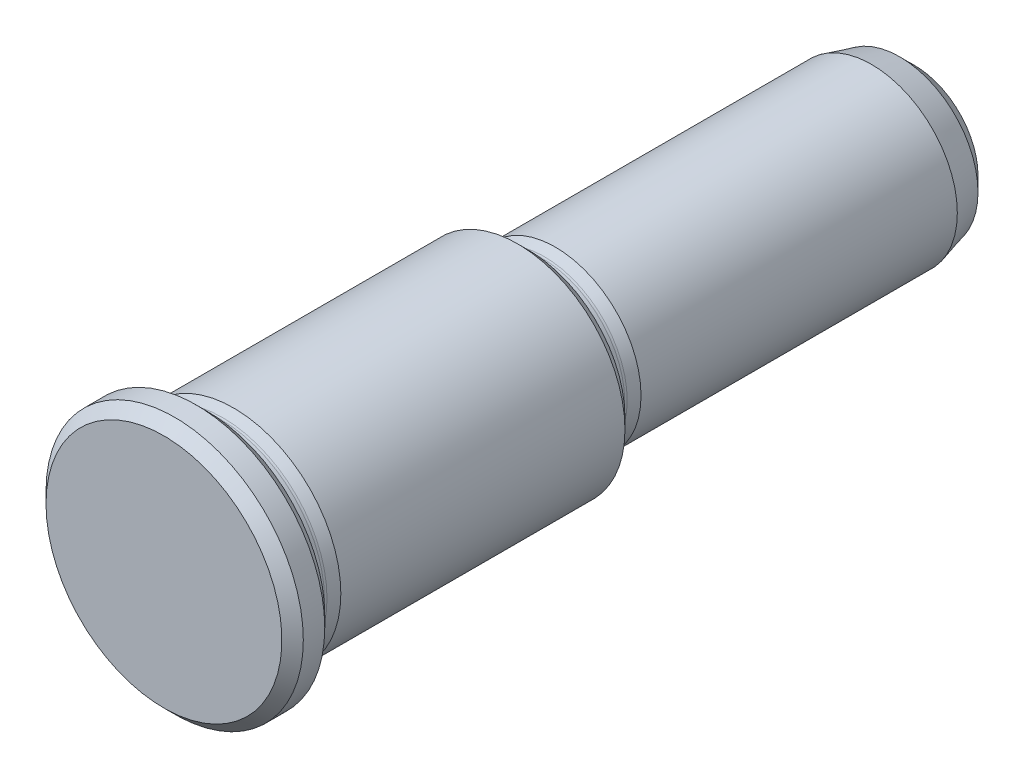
ISO-10303-21;
HEADER;
FILE_DESCRIPTION(('STEP AP214'),'2;1');
FILE_NAME('part.step','',(''),(''),'','','');
FILE_SCHEMA(('AUTOMOTIVE_DESIGN { 1 0 10303 214 1 1 1 1 }'));
ENDSEC;
DATA;
#1=APPLICATION_CONTEXT('core data for automotive mechanical design processes');
#2=APPLICATION_PROTOCOL_DEFINITION('international standard','automotive_design',2000,#1);
#3=PRODUCT_CONTEXT('',#1,'mechanical');
#4=PRODUCT('Part','Part','',(#3));
#5=PRODUCT_RELATED_PRODUCT_CATEGORY('part','',(#4));
#6=PRODUCT_DEFINITION_FORMATION('','',#4);
#7=PRODUCT_DEFINITION_CONTEXT('part definition',#1,'design');
#8=PRODUCT_DEFINITION('design','',#6,#7);
#9=PRODUCT_DEFINITION_SHAPE('','',#8);
#10=(LENGTH_UNIT() NAMED_UNIT(*) SI_UNIT(.MILLI.,.METRE.));
#11=(NAMED_UNIT(*) PLANE_ANGLE_UNIT() SI_UNIT($,.RADIAN.));
#12=(NAMED_UNIT(*) SI_UNIT($,.STERADIAN.) SOLID_ANGLE_UNIT());
#13=UNCERTAINTY_MEASURE_WITH_UNIT(LENGTH_MEASURE(1.E-05),#10,'distance_accuracy_value','');
#14=(GEOMETRIC_REPRESENTATION_CONTEXT(3) GLOBAL_UNCERTAINTY_ASSIGNED_CONTEXT((#13)) GLOBAL_UNIT_ASSIGNED_CONTEXT((#10,
#11,#12)) REPRESENTATION_CONTEXT('',''));
#15=CARTESIAN_POINT('',(0.,0.,0.));
#16=DIRECTION('',(0.,0.,1.));
#17=DIRECTION('',(1.,0.,0.));
#18=AXIS2_PLACEMENT_3D('',#15,#16,#17);
#19=CARTESIAN_POINT('',(0.,0.,0.));
#20=DIRECTION('',(0.,0.,-1.));
#21=DIRECTION('',(-1.,0.,0.));
#22=AXIS2_PLACEMENT_3D('',#19,#20,#21);
#23=PLANE('',#22);
#24=CARTESIAN_POINT('',(0.,0.,0.));
#25=DIRECTION('',(0.,0.,-1.));
#26=DIRECTION('',(-1.,0.,0.));
#27=AXIS2_PLACEMENT_3D('',#24,#25,#26);
#28=CIRCLE('',#27,11.);
#29=CARTESIAN_POINT('',(-11.,0.,0.));
#30=VERTEX_POINT('',#29);
#31=EDGE_CURVE('E9',#30,#30,#28,.F.);
#32=ORIENTED_EDGE('',*,*,#31,.T.);
#33=EDGE_LOOP('',(#32));
#34=FACE_BOUND('',#33,.T.);
#35=ADVANCED_FACE('F14',(#34),#23,.F.);
#36=CARTESIAN_POINT('',(0.,0.,0.));
#37=DIRECTION('',(0.,0.,1.));
#38=DIRECTION('',(1.,0.,0.));
#39=AXIS2_PLACEMENT_3D('',#36,#37,#38);
#40=CYLINDRICAL_SURFACE('',#39,12.);
#41=CARTESIAN_POINT('',(0.,0.,-3.));
#42=DIRECTION('',(0.,0.,1.));
#43=DIRECTION('',(1.,0.,0.));
#44=AXIS2_PLACEMENT_3D('',#41,#42,#43);
#45=CIRCLE('',#44,12.);
#46=CARTESIAN_POINT('',(12.,0.,-3.));
#47=VERTEX_POINT('',#46);
#48=EDGE_CURVE('E25',#47,#47,#45,.T.);
#49=ORIENTED_EDGE('',*,*,#48,.T.);
#50=EDGE_LOOP('',(#49));
#51=FACE_BOUND('',#50,.T.);
#52=CARTESIAN_POINT('',(0.,0.,-1.));
#53=DIRECTION('',(0.,0.,-1.));
#54=DIRECTION('',(-1.,0.,0.));
#55=AXIS2_PLACEMENT_3D('',#52,#53,#54);
#56=CIRCLE('',#55,12.);
#57=CARTESIAN_POINT('',(-12.,0.,-1.));
#58=VERTEX_POINT('',#57);
#59=EDGE_CURVE('E29',#58,#58,#56,.T.);
#60=ORIENTED_EDGE('',*,*,#59,.T.);
#61=EDGE_LOOP('',(#60));
#62=FACE_BOUND('',#61,.T.);
#63=ADVANCED_FACE('F100',(#51,#62),#40,.T.);
#64=CARTESIAN_POINT('',(0.,12.,-4.));
#65=DIRECTION('',(0.,0.,1.));
#66=DIRECTION('',(1.,0.,0.));
#67=AXIS2_PLACEMENT_3D('',#64,#65,#66);
#68=PLANE('',#67);
#69=CARTESIAN_POINT('',(0.,0.,-4.));
#70=DIRECTION('',(0.,0.,1.));
#71=DIRECTION('',(1.,0.,0.));
#72=AXIS2_PLACEMENT_3D('',#69,#70,#71);
#73=CIRCLE('',#72,11.);
#74=CARTESIAN_POINT('',(11.,0.,-4.));
#75=VERTEX_POINT('',#74);
#76=EDGE_CURVE('E21',#75,#75,#73,.F.);
#77=ORIENTED_EDGE('',*,*,#76,.T.);
#78=EDGE_LOOP('',(#77));
#79=FACE_BOUND('',#78,.T.);
#80=CARTESIAN_POINT('',(0.,0.,-4.));
#81=DIRECTION('',(0.,0.,1.));
#82=DIRECTION('',(1.,0.,0.));
#83=AXIS2_PLACEMENT_3D('',#80,#81,#82);
#84=CIRCLE('',#83,10.5);
#85=CARTESIAN_POINT('',(10.5,0.,-4.));
#86=VERTEX_POINT('',#85);
#87=EDGE_CURVE('E46',#86,#86,#84,.T.);
#88=ORIENTED_EDGE('',*,*,#87,.T.);
#89=EDGE_LOOP('',(#88));
#90=FACE_BOUND('',#89,.T.);
#91=ADVANCED_FACE('F106',(#79,#90),#68,.F.);
#92=CARTESIAN_POINT('',(0.,0.,-4.8));
#93=DIRECTION('',(0.,0.,1.));
#94=DIRECTION('',(1.,0.,0.));
#95=AXIS2_PLACEMENT_3D('',#92,#93,#94);
#96=TOROIDAL_SURFACE('',#95,10.5,0.8);
#97=ORIENTED_EDGE('',*,*,#87,.F.);
#98=EDGE_LOOP('',(#97));
#99=FACE_BOUND('',#98,.T.);
#100=CARTESIAN_POINT('',(0.,0.,-4.8));
#101=DIRECTION('',(0.,0.,1.));
#102=DIRECTION('',(1.,0.,0.));
#103=AXIS2_PLACEMENT_3D('',#100,#101,#102);
#104=CIRCLE('',#103,9.7);
#105=CARTESIAN_POINT('',(9.7,0.,-4.8));
#106=VERTEX_POINT('',#105);
#107=EDGE_CURVE('E49',#106,#106,#104,.T.);
#108=ORIENTED_EDGE('',*,*,#107,.T.);
#109=EDGE_LOOP('',(#108));
#110=FACE_BOUND('',#109,.T.);
#111=ADVANCED_FACE('F176',(#99,#110),#96,.F.);
#112=CARTESIAN_POINT('',(0.,0.,0.));
#113=DIRECTION('',(0.,0.,1.));
#114=DIRECTION('',(1.,0.,0.));
#115=AXIS2_PLACEMENT_3D('',#112,#113,#114);
#116=CYLINDRICAL_SURFACE('',#115,9.7);
#117=ORIENTED_EDGE('',*,*,#107,.F.);
#118=EDGE_LOOP('',(#117));
#119=FACE_BOUND('',#118,.T.);
#120=CARTESIAN_POINT('',(0.,0.,-5.27506275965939));
#121=DIRECTION('',(0.,0.,1.));
#122=DIRECTION('',(1.,0.,0.));
#123=AXIS2_PLACEMENT_3D('',#120,#121,#122);
#124=CIRCLE('',#123,9.7);
#125=CARTESIAN_POINT('',(9.7,0.,-5.27506275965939));
#126=VERTEX_POINT('',#125);
#127=EDGE_CURVE('E52',#126,#126,#124,.T.);
#128=ORIENTED_EDGE('',*,*,#127,.T.);
#129=EDGE_LOOP('',(#128));
#130=FACE_BOUND('',#129,.T.);
#131=ADVANCED_FACE('F232',(#119,#130),#116,.T.);
#132=CARTESIAN_POINT('',(0.,0.,-5.27506275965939));
#133=DIRECTION('',(0.,0.,1.));
#134=DIRECTION('',(1.,0.,0.));
#135=AXIS2_PLACEMENT_3D('',#132,#133,#134);
#136=TOROIDAL_SURFACE('',#135,10.5,0.8);
#137=ORIENTED_EDGE('',*,*,#127,.F.);
#138=EDGE_LOOP('',(#137));
#139=FACE_BOUND('',#138,.T.);
#140=CARTESIAN_POINT('',(0.,0.,-5.4821179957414));
#141=DIRECTION('',(0.,0.,1.));
#142=DIRECTION('',(1.,0.,0.));
#143=AXIS2_PLACEMENT_3D('',#140,#141,#142);
#144=CIRCLE('',#143,9.72725933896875);
#145=CARTESIAN_POINT('',(9.72725933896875,0.,-5.4821179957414));
#146=VERTEX_POINT('',#145);
#147=EDGE_CURVE('E55',#146,#146,#144,.T.);
#148=ORIENTED_EDGE('',*,*,#147,.T.);
#149=EDGE_LOOP('',(#148));
#150=FACE_BOUND('',#149,.T.);
#151=ADVANCED_FACE('F222',(#139,#150),#136,.F.);
#152=CARTESIAN_POINT('',(0.,0.,-6.5));
#153=DIRECTION('',(0.,0.,-1.));
#154=DIRECTION('',(-1.,0.,0.));
#155=AXIS2_PLACEMENT_3D('',#152,#153,#154);
#156=CONICAL_SURFACE('',#155,10.,0.261799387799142);
#157=ORIENTED_EDGE('',*,*,#147,.F.);
#158=EDGE_LOOP('',(#157));
#159=FACE_BOUND('',#158,.T.);
#160=CARTESIAN_POINT('',(0.,0.,-6.5));
#161=DIRECTION('',(0.,0.,1.));
#162=DIRECTION('',(1.,0.,0.));
#163=AXIS2_PLACEMENT_3D('',#160,#161,#162);
#164=CIRCLE('',#163,10.);
#165=CARTESIAN_POINT('',(10.,0.,-6.5));
#166=VERTEX_POINT('',#165);
#167=EDGE_CURVE('E58',#166,#166,#164,.T.);
#168=ORIENTED_EDGE('',*,*,#167,.T.);
#169=EDGE_LOOP('',(#168));
#170=FACE_BOUND('',#169,.T.);
#171=ADVANCED_FACE('F164',(#159,#170),#156,.T.);
#172=CARTESIAN_POINT('',(0.,0.,0.));
#173=DIRECTION('',(0.,0.,1.));
#174=DIRECTION('',(1.,0.,0.));
#175=AXIS2_PLACEMENT_3D('',#172,#173,#174);
#176=CYLINDRICAL_SURFACE('',#175,10.);
#177=CARTESIAN_POINT('',(0.,0.,-33.));
#178=DIRECTION('',(0.,0.,1.));
#179=DIRECTION('',(1.,0.,0.));
#180=AXIS2_PLACEMENT_3D('',#177,#178,#179);
#181=CIRCLE('',#180,10.);
#182=CARTESIAN_POINT('',(10.,0.,-33.));
#183=VERTEX_POINT('',#182);
#184=EDGE_CURVE('E37',#183,#183,#181,.T.);
#185=ORIENTED_EDGE('',*,*,#184,.T.);
#186=EDGE_LOOP('',(#185));
#187=FACE_BOUND('',#186,.T.);
#188=ORIENTED_EDGE('',*,*,#167,.F.);
#189=EDGE_LOOP('',(#188));
#190=FACE_BOUND('',#189,.T.);
#191=ADVANCED_FACE('F152',(#187,#190),#176,.T.);
#192=CARTESIAN_POINT('',(0.,10.,-34.));
#193=DIRECTION('',(0.,0.,1.));
#194=DIRECTION('',(1.,0.,0.));
#195=AXIS2_PLACEMENT_3D('',#192,#193,#194);
#196=PLANE('',#195);
#197=CARTESIAN_POINT('',(0.,0.,-34.));
#198=DIRECTION('',(0.,0.,1.));
#199=DIRECTION('',(1.,0.,0.));
#200=AXIS2_PLACEMENT_3D('',#197,#198,#199);
#201=CIRCLE('',#200,9.);
#202=CARTESIAN_POINT('',(9.,0.,-34.));
#203=VERTEX_POINT('',#202);
#204=EDGE_CURVE('E34',#203,#203,#201,.F.);
#205=ORIENTED_EDGE('',*,*,#204,.T.);
#206=EDGE_LOOP('',(#205));
#207=FACE_BOUND('',#206,.T.);
#208=CARTESIAN_POINT('',(0.,0.,-34.));
#209=DIRECTION('',(0.,0.,1.));
#210=DIRECTION('',(1.,0.,0.));
#211=AXIS2_PLACEMENT_3D('',#208,#209,#210);
#212=CIRCLE('',#211,8.5);
#213=CARTESIAN_POINT('',(8.5,0.,-34.));
#214=VERTEX_POINT('',#213);
#215=EDGE_CURVE('E61',#214,#214,#212,.T.);
#216=ORIENTED_EDGE('',*,*,#215,.T.);
#217=EDGE_LOOP('',(#216));
#218=FACE_BOUND('',#217,.T.);
#219=ADVANCED_FACE('F146',(#207,#218),#196,.F.);
#220=CARTESIAN_POINT('',(0.,0.,-34.8));
#221=DIRECTION('',(0.,0.,1.));
#222=DIRECTION('',(1.,0.,0.));
#223=AXIS2_PLACEMENT_3D('',#220,#221,#222);
#224=TOROIDAL_SURFACE('',#223,8.5,0.8);
#225=ORIENTED_EDGE('',*,*,#215,.F.);
#226=EDGE_LOOP('',(#225));
#227=FACE_BOUND('',#226,.T.);
#228=CARTESIAN_POINT('',(0.,0.,-34.8));
#229=DIRECTION('',(0.,0.,1.));
#230=DIRECTION('',(1.,0.,0.));
#231=AXIS2_PLACEMENT_3D('',#228,#229,#230);
#232=CIRCLE('',#231,7.7);
#233=CARTESIAN_POINT('',(7.7,0.,-34.8));
#234=VERTEX_POINT('',#233);
#235=EDGE_CURVE('E64',#234,#234,#232,.T.);
#236=ORIENTED_EDGE('',*,*,#235,.T.);
#237=EDGE_LOOP('',(#236));
#238=FACE_BOUND('',#237,.T.);
#239=ADVANCED_FACE('F151',(#227,#238),#224,.F.);
#240=CARTESIAN_POINT('',(0.,0.,0.));
#241=DIRECTION('',(0.,0.,1.));
#242=DIRECTION('',(1.,0.,0.));
#243=AXIS2_PLACEMENT_3D('',#240,#241,#242);
#244=CYLINDRICAL_SURFACE('',#243,7.7);
#245=ORIENTED_EDGE('',*,*,#235,.F.);
#246=EDGE_LOOP('',(#245));
#247=FACE_BOUND('',#246,.T.);
#248=CARTESIAN_POINT('',(0.,0.,-35.2750627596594));
#249=DIRECTION('',(0.,0.,1.));
#250=DIRECTION('',(1.,0.,0.));
#251=AXIS2_PLACEMENT_3D('',#248,#249,#250);
#252=CIRCLE('',#251,7.7);
#253=CARTESIAN_POINT('',(7.7,0.,-35.2750627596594));
#254=VERTEX_POINT('',#253);
#255=EDGE_CURVE('E67',#254,#254,#252,.T.);
#256=ORIENTED_EDGE('',*,*,#255,.T.);
#257=EDGE_LOOP('',(#256));
#258=FACE_BOUND('',#257,.T.);
#259=ADVANCED_FACE('F198',(#247,#258),#244,.T.);
#260=CARTESIAN_POINT('',(0.,0.,-35.2750627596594));
#261=DIRECTION('',(0.,0.,1.));
#262=DIRECTION('',(1.,0.,0.));
#263=AXIS2_PLACEMENT_3D('',#260,#261,#262);
#264=TOROIDAL_SURFACE('',#263,8.5,0.8);
#265=ORIENTED_EDGE('',*,*,#255,.F.);
#266=EDGE_LOOP('',(#265));
#267=FACE_BOUND('',#266,.T.);
#268=CARTESIAN_POINT('',(0.,0.,-35.4821179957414));
#269=DIRECTION('',(0.,0.,1.));
#270=DIRECTION('',(1.,0.,0.));
#271=AXIS2_PLACEMENT_3D('',#268,#269,#270);
#272=CIRCLE('',#271,7.72725933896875);
#273=CARTESIAN_POINT('',(7.72725933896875,0.,-35.4821179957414));
#274=VERTEX_POINT('',#273);
#275=EDGE_CURVE('E70',#274,#274,#272,.T.);
#276=ORIENTED_EDGE('',*,*,#275,.T.);
#277=EDGE_LOOP('',(#276));
#278=FACE_BOUND('',#277,.T.);
#279=ADVANCED_FACE('F187',(#267,#278),#264,.F.);
#280=CARTESIAN_POINT('',(0.,0.,-36.5));
#281=DIRECTION('',(0.,0.,-1.));
#282=DIRECTION('',(-1.,0.,0.));
#283=AXIS2_PLACEMENT_3D('',#280,#281,#282);
#284=CONICAL_SURFACE('',#283,8.,0.261799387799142);
#285=ORIENTED_EDGE('',*,*,#275,.F.);
#286=EDGE_LOOP('',(#285));
#287=FACE_BOUND('',#286,.T.);
#288=CARTESIAN_POINT('',(0.,0.,-36.5));
#289=DIRECTION('',(0.,0.,1.));
#290=DIRECTION('',(1.,0.,0.));
#291=AXIS2_PLACEMENT_3D('',#288,#289,#290);
#292=CIRCLE('',#291,8.);
#293=CARTESIAN_POINT('',(8.,0.,-36.5));
#294=VERTEX_POINT('',#293);
#295=EDGE_CURVE('E73',#294,#294,#292,.T.);
#296=ORIENTED_EDGE('',*,*,#295,.T.);
#297=EDGE_LOOP('',(#296));
#298=FACE_BOUND('',#297,.T.);
#299=ADVANCED_FACE('F96',(#287,#298),#284,.T.);
#300=CARTESIAN_POINT('',(0.,0.,0.));
#301=DIRECTION('',(0.,0.,1.));
#302=DIRECTION('',(1.,0.,0.));
#303=AXIS2_PLACEMENT_3D('',#300,#301,#302);
#304=CYLINDRICAL_SURFACE('',#303,8.);
#305=ORIENTED_EDGE('',*,*,#295,.F.);
#306=EDGE_LOOP('',(#305));
#307=FACE_BOUND('',#306,.T.);
#308=CARTESIAN_POINT('',(0.,0.,-66.));
#309=DIRECTION('',(0.,0.,1.));
#310=DIRECTION('',(1.,0.,0.));
#311=AXIS2_PLACEMENT_3D('',#308,#309,#310);
#312=CIRCLE('',#311,8.);
#313=CARTESIAN_POINT('',(8.,0.,-66.));
#314=VERTEX_POINT('',#313);
#315=EDGE_CURVE('E76',#314,#314,#312,.T.);
#316=ORIENTED_EDGE('',*,*,#315,.T.);
#317=EDGE_LOOP('',(#316));
#318=FACE_BOUND('',#317,.T.);
#319=ADVANCED_FACE('F80',(#307,#318),#304,.T.);
#320=CARTESIAN_POINT('',(0.,0.,-70.));
#321=DIRECTION('',(0.,0.,1.));
#322=DIRECTION('',(1.,0.,0.));
#323=AXIS2_PLACEMENT_3D('',#320,#321,#322);
#324=CONICAL_SURFACE('',#323,6.92820323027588,0.261799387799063);
#325=CARTESIAN_POINT('',(0.,0.,-68.6339745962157));
#326=DIRECTION('',(0.,0.,-1.));
#327=DIRECTION('',(-1.,0.,0.));
#328=AXIS2_PLACEMENT_3D('',#325,#326,#327);
#329=CIRCLE('',#328,7.29422863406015);
#330=CARTESIAN_POINT('',(-7.29422863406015,0.,-68.6339745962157));
#331=VERTEX_POINT('',#330);
#332=EDGE_CURVE('E43',#331,#331,#329,.F.);
#333=ORIENTED_EDGE('',*,*,#332,.T.);
#334=EDGE_LOOP('',(#333));
#335=FACE_BOUND('',#334,.T.);
#336=ORIENTED_EDGE('',*,*,#315,.F.);
#337=EDGE_LOOP('',(#336));
#338=FACE_BOUND('',#337,.T.);
#339=ADVANCED_FACE('F82',(#335,#338),#324,.T.);
#340=CARTESIAN_POINT('',(0.,6.92820323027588,-70.));
#341=DIRECTION('',(0.,0.,1.));
#342=DIRECTION('',(1.,0.,0.));
#343=AXIS2_PLACEMENT_3D('',#340,#341,#342);
#344=PLANE('',#343);
#345=CARTESIAN_POINT('',(0.,0.,-70.));
#346=DIRECTION('',(0.,0.,1.));
#347=DIRECTION('',(1.,0.,0.));
#348=AXIS2_PLACEMENT_3D('',#345,#346,#347);
#349=CIRCLE('',#348,5.92820323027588);
#350=CARTESIAN_POINT('',(5.92820323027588,0.,-70.));
#351=VERTEX_POINT('',#350);
#352=EDGE_CURVE('E40',#351,#351,#349,.F.);
#353=ORIENTED_EDGE('',*,*,#352,.T.);
#354=EDGE_LOOP('',(#353));
#355=FACE_BOUND('',#354,.T.);
#356=ADVANCED_FACE('F84',(#355),#344,.F.);
#357=CARTESIAN_POINT('',(0.,0.,-68.6339745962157));
#358=DIRECTION('',(0.,0.,1.));
#359=DIRECTION('',(1.,0.,0.));
#360=AXIS2_PLACEMENT_3D('',#357,#358,#359);
#361=CONICAL_SURFACE('',#360,7.29422863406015,0.785398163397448);
#362=ORIENTED_EDGE('',*,*,#352,.F.);
#363=EDGE_LOOP('',(#362));
#364=FACE_BOUND('',#363,.T.);
#365=ORIENTED_EDGE('',*,*,#332,.F.);
#366=EDGE_LOOP('',(#365));
#367=FACE_BOUND('',#366,.T.);
#368=ADVANCED_FACE('F93',(#364,#367),#361,.T.);
#369=CARTESIAN_POINT('',(0.,0.,-33.));
#370=DIRECTION('',(0.,0.,1.));
#371=DIRECTION('',(1.,0.,0.));
#372=AXIS2_PLACEMENT_3D('',#369,#370,#371);
#373=CONICAL_SURFACE('',#372,10.,0.785398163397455);
#374=ORIENTED_EDGE('',*,*,#204,.F.);
#375=EDGE_LOOP('',(#374));
#376=FACE_BOUND('',#375,.T.);
#377=ORIENTED_EDGE('',*,*,#184,.F.);
#378=EDGE_LOOP('',(#377));
#379=FACE_BOUND('',#378,.T.);
#380=ADVANCED_FACE('F113',(#376,#379),#373,.T.);
#381=CARTESIAN_POINT('',(0.,0.,-3.));
#382=DIRECTION('',(0.,0.,1.));
#383=DIRECTION('',(1.,0.,0.));
#384=AXIS2_PLACEMENT_3D('',#381,#382,#383);
#385=CONICAL_SURFACE('',#384,12.,0.78539816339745);
#386=ORIENTED_EDGE('',*,*,#76,.F.);
#387=EDGE_LOOP('',(#386));
#388=FACE_BOUND('',#387,.T.);
#389=ORIENTED_EDGE('',*,*,#48,.F.);
#390=EDGE_LOOP('',(#389));
#391=FACE_BOUND('',#390,.T.);
#392=ADVANCED_FACE('F116',(#388,#391),#385,.T.);
#393=CARTESIAN_POINT('',(0.,0.,0.));
#394=DIRECTION('',(0.,0.,-1.));
#395=DIRECTION('',(-1.,0.,0.));
#396=AXIS2_PLACEMENT_3D('',#393,#394,#395);
#397=CONICAL_SURFACE('',#396,11.,0.785398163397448);
#398=ORIENTED_EDGE('',*,*,#59,.F.);
#399=EDGE_LOOP('',(#398));
#400=FACE_BOUND('',#399,.T.);
#401=ORIENTED_EDGE('',*,*,#31,.F.);
#402=EDGE_LOOP('',(#401));
#403=FACE_BOUND('',#402,.T.);
#404=ADVANCED_FACE('F16',(#400,#403),#397,.T.);
#405=CLOSED_SHELL('',(#35,#63,#91,#111,#131,#151,#171,#191,#219,#239,#259,#279,#299,#319,#339,
#356,#368,#380,#392,#404));
#406=MANIFOLD_SOLID_BREP('B1',#405);
#407=ADVANCED_BREP_SHAPE_REPRESENTATION('',(#18,#406),#14);
#408=SHAPE_DEFINITION_REPRESENTATION(#9,#407);
ENDSEC;
END-ISO-10303-21;
